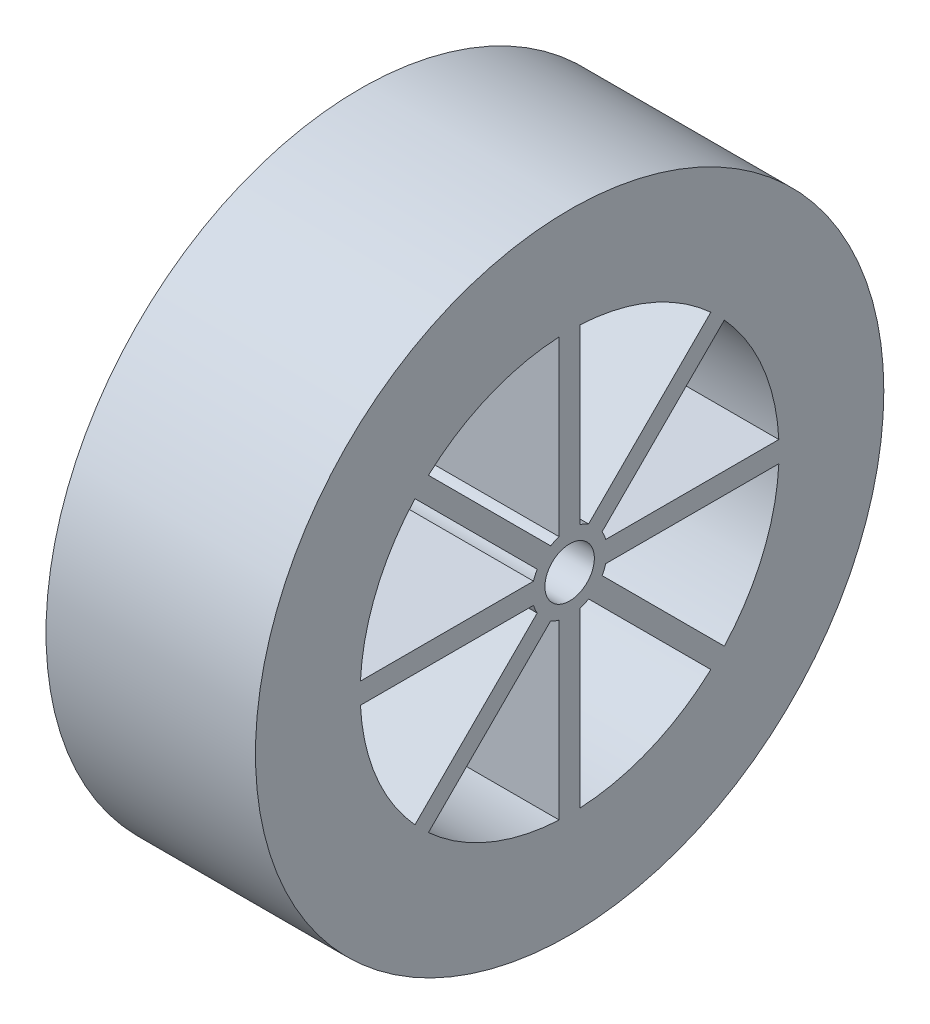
from build123d import *

# Parameters (mm, degrees)
SKETCH1_R           = 19.05
BOSS_EXTRUDE1_DEPTH = 12.7
SKETCH2_R           = 1.5
CUT_EXTRUDE1_DEPTH  = 25.4


with BuildPart() as part:
    # Sketch1 → Boss-Extrude1 (new body)
    with BuildSketch(Plane(origin=(0, 0, 0), x_dir=(0, 0, -1), z_dir=(1, 0, 0))):
        Circle(SKETCH1_R)
        with BuildLine():
            ThreePointArc((2.19024668, 0.635), (2.095258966, 0.900164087), (1.968307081, 1.151595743))
            Line((1.968307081, 1.151595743), (9.379322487, 8.562611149))
            ThreePointArc((9.379322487, 8.562611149), (11.722225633, 4.88665798), (12.684115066, 0.635))
            Line((12.684115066, 0.635), (2.19024668, 0.635))
        make_face(mode=Mode.SUBTRACT)
        with BuildLine():
            ThreePointArc((1.968307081, -1.151595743), (2.095258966, -0.900164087), (2.19024668, -0.635))
            Line((2.19024668, -0.635), (12.684115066, -0.635))
            ThreePointArc((12.684115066, -0.635), (11.722225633, -4.88665798), (9.379322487, -8.562611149))
            Line((9.379322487, -8.562611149), (1.968307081, -1.151595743))
        make_face(mode=Mode.SUBTRACT)
        with BuildLine():
            ThreePointArc((0.635, -2.19024668), (0.899070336, -2.095728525), (1.149540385, -1.969508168))
            Line((1.149540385, -1.969508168), (8.560908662, -9.380876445))
            ThreePointArc((8.560908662, -9.380876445), (4.885594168, -11.722669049), (0.635, -12.684115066))
            Line((0.635, -12.684115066), (0.635, -2.19024668))
        make_face(mode=Mode.SUBTRACT)
        with BuildLine():
            ThreePointArc((-1.149540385, -1.969508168), (-0.899070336, -2.095728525), (-0.635, -2.19024668))
            Line((-0.635, -2.19024668), (-0.635, -12.684115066))
            ThreePointArc((-0.635, -12.684115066), (-4.885594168, -11.722669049), (-8.560908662, -9.380876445))
            Line((-8.560908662, -9.380876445), (-1.149540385, -1.969508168))
        make_face(mode=Mode.SUBTRACT)
        with BuildLine():
            ThreePointArc((-2.19024668, -0.635), (-2.095258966, -0.900164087), (-1.968307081, -1.151595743))
            Line((-1.968307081, -1.151595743), (-9.379322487, -8.562611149))
            ThreePointArc((-9.379322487, -8.562611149), (-11.722225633, -4.88665798), (-12.684115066, -0.635))
            Line((-12.684115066, -0.635), (-2.19024668, -0.635))
        make_face(mode=Mode.SUBTRACT)
        with BuildLine():
            ThreePointArc((-1.968307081, 1.151595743), (-2.095258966, 0.900164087), (-2.19024668, 0.635))
            Line((-2.19024668, 0.635), (-12.684115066, 0.635))
            ThreePointArc((-12.684115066, 0.635), (-11.722225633, 4.88665798), (-9.379322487, 8.562611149))
            Line((-9.379322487, 8.562611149), (-1.968307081, 1.151595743))
        make_face(mode=Mode.SUBTRACT)
        with BuildLine():
            ThreePointArc((-0.635, 2.19024668), (-0.899070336, 2.095728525), (-1.149540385, 1.969508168))
            Line((-1.149540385, 1.969508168), (-8.560908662, 9.380876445))
            ThreePointArc((-8.560908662, 9.380876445), (-4.885594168, 11.722669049), (-0.635, 12.684115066))
            Line((-0.635, 12.684115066), (-0.635, 2.19024668))
        make_face(mode=Mode.SUBTRACT)
        with BuildLine():
            ThreePointArc((1.149540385, 1.969508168), (0.899070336, 2.095728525), (0.635, 2.19024668))
            Line((0.635, 2.19024668), (0.635, 12.684115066))
            ThreePointArc((0.635, 12.684115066), (4.885594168, 11.722669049), (8.560908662, 9.380876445))
            Line((8.560908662, 9.380876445), (1.149540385, 1.969508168))
        make_face(mode=Mode.SUBTRACT)
    extrude(amount=BOSS_EXTRUDE1_DEPTH)

    # Sketch2 → Cut-Extrude1 (cut)
    with BuildSketch(Plane(origin=(12.7, 0, 0), x_dir=(0, 0, -1), z_dir=(1, 0, 0))):
        Circle(SKETCH2_R)
    extrude(amount=-CUT_EXTRUDE1_DEPTH, mode=Mode.SUBTRACT)


solid = part.part
